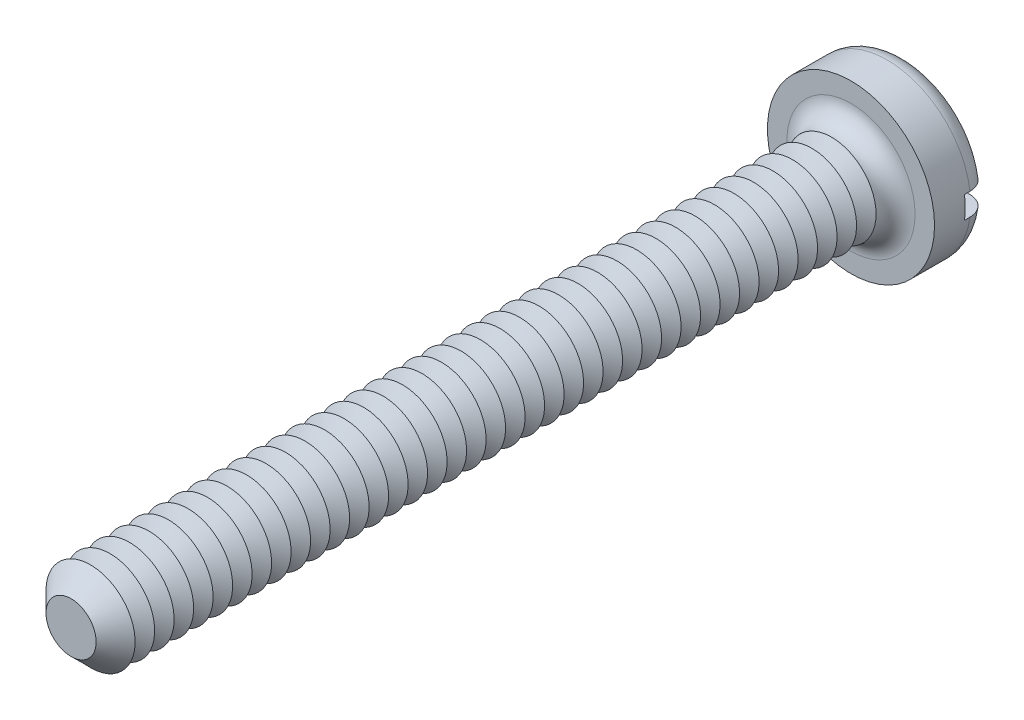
from build123d import *

# Parameters (mm, degrees)
SKETCH3_R           = 1.5
BOSS_EXTRUDE2_DEPTH = 1
SKETCH4_R           = 0.8
BOSS_EXTRUDE3_DEPTH = 14
FILLET1_R           = 0.35
CHAMFER1_SIZE       = 0.35
LPATTERN1_COUNT     = 38
LPATTERN1_PITCH     = 0.35
SKETCH8_W           = 3
SKETCH8_H           = 0.4
CUT_EXTRUDE1_DEPTH  = 0.45


with BuildPart() as part:
    # Sketch3 → Boss-Extrude2 (new body)
    with BuildSketch(Plane.XY):
        Circle(SKETCH3_R)
    extrude(amount=-BOSS_EXTRUDE2_DEPTH)

    # Sketch4 → Boss-Extrude3 (add)
    with BuildSketch(Plane.XY):
        Circle(SKETCH4_R)
    extrude(amount=BOSS_EXTRUDE3_DEPTH)

    # Fillet1
    fillet1_edges = [part.edges().sort_by_distance(p)[0] for p in [
        (-1.5, 0, -1),
        (-0.8, 0, 0),
    ]]
    fillet(fillet1_edges, radius=FILLET1_R)

    # Chamfer1
    chamfer1_edges = [part.edges().sort_by_distance(p)[0] for p in [
        (-0.8, 0, 14),
    ]]
    chamfer(chamfer1_edges, length=CHAMFER1_SIZE)

    # Sketch6 → Cut-Revolve1 (revolve, cut)
    with BuildSketch(Plane(origin=(0, 0, 0), x_dir=(0, 0, -1), z_dir=(1, 0, 0)), mode=Mode.PRIVATE) as cut_revolve1_sk:
        Polygon((-0.35, 0.8), (-0.525, 0.496891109), (-0.7, 0.8), align=None)
    cut_revolve1 = revolve(cut_revolve1_sk.sketch.rotate(Axis((0, 0, -1.694361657), (0, 0, 1)), 90), axis=Axis((0, 0, -1.694361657), (0, 0, 1)), mode=Mode.SUBTRACT)

    # LPattern1: Cut-Revolve1 ×38
    with Locations(*[(0, 0, i * LPATTERN1_PITCH) for i in range(1, LPATTERN1_COUNT)]):
        add(cut_revolve1, mode=Mode.SUBTRACT)

    # Sketch8 → Cut-Extrude1 (cut)
    with BuildSketch(Plane(origin=(0, 0, -1), x_dir=(-1, 0, 0), z_dir=(0, 0, -1))):
        Rectangle(SKETCH8_W, SKETCH8_H)
    extrude(amount=-CUT_EXTRUDE1_DEPTH, mode=Mode.SUBTRACT)


solid = part.part
